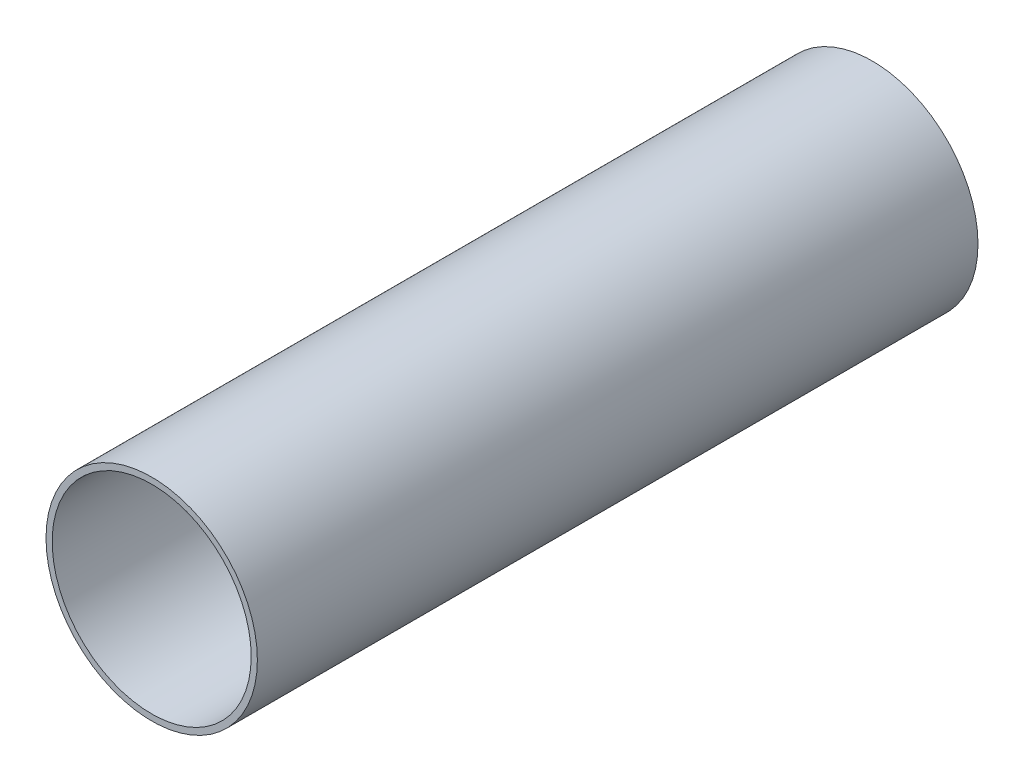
ISO-10303-21;
HEADER;
FILE_DESCRIPTION(('STEP AP214'),'2;1');
FILE_NAME('part.step','',(''),(''),'','','');
FILE_SCHEMA(('AUTOMOTIVE_DESIGN { 1 0 10303 214 1 1 1 1 }'));
ENDSEC;
DATA;
#1=APPLICATION_CONTEXT('core data for automotive mechanical design processes');
#2=APPLICATION_PROTOCOL_DEFINITION('international standard','automotive_design',2000,#1);
#3=PRODUCT_CONTEXT('',#1,'mechanical');
#4=PRODUCT('Part','Part','',(#3));
#5=PRODUCT_RELATED_PRODUCT_CATEGORY('part','',(#4));
#6=PRODUCT_DEFINITION_FORMATION('','',#4);
#7=PRODUCT_DEFINITION_CONTEXT('part definition',#1,'design');
#8=PRODUCT_DEFINITION('design','',#6,#7);
#9=PRODUCT_DEFINITION_SHAPE('','',#8);
#10=(LENGTH_UNIT() NAMED_UNIT(*) SI_UNIT(.MILLI.,.METRE.));
#11=(NAMED_UNIT(*) PLANE_ANGLE_UNIT() SI_UNIT($,.RADIAN.));
#12=(NAMED_UNIT(*) SI_UNIT($,.STERADIAN.) SOLID_ANGLE_UNIT());
#13=UNCERTAINTY_MEASURE_WITH_UNIT(LENGTH_MEASURE(1.E-05),#10,'distance_accuracy_value','');
#14=(GEOMETRIC_REPRESENTATION_CONTEXT(3) GLOBAL_UNCERTAINTY_ASSIGNED_CONTEXT((#13)) GLOBAL_UNIT_ASSIGNED_CONTEXT((#10,
#11,#12)) REPRESENTATION_CONTEXT('',''));
#15=CARTESIAN_POINT('',(0.,0.,0.));
#16=DIRECTION('',(0.,0.,1.));
#17=DIRECTION('',(1.,0.,0.));
#18=AXIS2_PLACEMENT_3D('',#15,#16,#17);
#19=CARTESIAN_POINT('',(0.,0.,205.));
#20=DIRECTION('',(0.,0.,-1.));
#21=DIRECTION('',(-1.,0.,0.));
#22=AXIS2_PLACEMENT_3D('',#19,#20,#21);
#23=CYLINDRICAL_SURFACE('',#22,30.065);
#24=CARTESIAN_POINT('',(0.,0.,205.));
#25=DIRECTION('',(0.,0.,1.));
#26=DIRECTION('',(1.,0.,0.));
#27=AXIS2_PLACEMENT_3D('',#24,#25,#26);
#28=CIRCLE('',#27,30.065);
#29=CARTESIAN_POINT('',(-30.065,0.,205.));
#30=VERTEX_POINT('',#29);
#31=EDGE_CURVE('E10',#30,#30,#28,.T.);
#32=CARTESIAN_POINT('',(0.,0.,0.));
#33=DIRECTION('',(0.,0.,1.));
#34=DIRECTION('',(1.,0.,0.));
#35=AXIS2_PLACEMENT_3D('',#32,#33,#34);
#36=CIRCLE('',#35,30.065);
#37=CARTESIAN_POINT('',(-30.065,0.,0.));
#38=VERTEX_POINT('',#37);
#39=EDGE_CURVE('E46',#38,#38,#36,.T.);
#40=CARTESIAN_POINT('',(-30.065,0.,205.));
#41=CARTESIAN_POINT('',(-30.065,0.,202.864583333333));
#42=CARTESIAN_POINT('',(-30.065,0.,200.729166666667));
#43=CARTESIAN_POINT('',(-30.065,0.,196.458333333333));
#44=CARTESIAN_POINT('',(-30.065,0.,194.322916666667));
#45=CARTESIAN_POINT('',(-30.065,0.,190.052083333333));
#46=CARTESIAN_POINT('',(-30.065,0.,187.916666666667));
#47=CARTESIAN_POINT('',(-30.065,0.,183.645833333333));
#48=CARTESIAN_POINT('',(-30.065,0.,181.510416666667));
#49=CARTESIAN_POINT('',(-30.065,0.,177.239583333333));
#50=CARTESIAN_POINT('',(-30.065,0.,175.104166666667));
#51=CARTESIAN_POINT('',(-30.065,0.,170.833333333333));
#52=CARTESIAN_POINT('',(-30.065,0.,168.697916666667));
#53=CARTESIAN_POINT('',(-30.065,0.,164.427083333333));
#54=CARTESIAN_POINT('',(-30.065,0.,162.291666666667));
#55=CARTESIAN_POINT('',(-30.065,0.,158.020833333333));
#56=CARTESIAN_POINT('',(-30.065,0.,155.885416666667));
#57=CARTESIAN_POINT('',(-30.065,0.,151.614583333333));
#58=CARTESIAN_POINT('',(-30.065,0.,149.479166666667));
#59=CARTESIAN_POINT('',(-30.065,0.,145.208333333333));
#60=CARTESIAN_POINT('',(-30.065,0.,143.072916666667));
#61=CARTESIAN_POINT('',(-30.065,0.,138.802083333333));
#62=CARTESIAN_POINT('',(-30.065,0.,136.666666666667));
#63=CARTESIAN_POINT('',(-30.065,0.,132.395833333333));
#64=CARTESIAN_POINT('',(-30.065,0.,130.260416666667));
#65=CARTESIAN_POINT('',(-30.065,0.,125.989583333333));
#66=CARTESIAN_POINT('',(-30.065,0.,123.854166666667));
#67=CARTESIAN_POINT('',(-30.065,0.,119.583333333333));
#68=CARTESIAN_POINT('',(-30.065,0.,117.447916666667));
#69=CARTESIAN_POINT('',(-30.065,0.,113.177083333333));
#70=CARTESIAN_POINT('',(-30.065,0.,111.041666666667));
#71=CARTESIAN_POINT('',(-30.065,0.,106.770833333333));
#72=CARTESIAN_POINT('',(-30.065,0.,104.635416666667));
#73=CARTESIAN_POINT('',(-30.065,0.,100.364583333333));
#74=CARTESIAN_POINT('',(-30.065,0.,98.2291666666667));
#75=CARTESIAN_POINT('',(-30.065,0.,93.9583333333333));
#76=CARTESIAN_POINT('',(-30.065,0.,91.8229166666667));
#77=CARTESIAN_POINT('',(-30.065,0.,87.5520833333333));
#78=CARTESIAN_POINT('',(-30.065,0.,85.4166666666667));
#79=CARTESIAN_POINT('',(-30.065,0.,81.1458333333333));
#80=CARTESIAN_POINT('',(-30.065,0.,79.0104166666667));
#81=CARTESIAN_POINT('',(-30.065,0.,74.7395833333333));
#82=CARTESIAN_POINT('',(-30.065,0.,72.6041666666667));
#83=CARTESIAN_POINT('',(-30.065,0.,68.3333333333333));
#84=CARTESIAN_POINT('',(-30.065,0.,66.1979166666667));
#85=CARTESIAN_POINT('',(-30.065,0.,61.9270833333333));
#86=CARTESIAN_POINT('',(-30.065,0.,59.7916666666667));
#87=CARTESIAN_POINT('',(-30.065,0.,55.5208333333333));
#88=CARTESIAN_POINT('',(-30.065,0.,53.3854166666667));
#89=CARTESIAN_POINT('',(-30.065,0.,49.1145833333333));
#90=CARTESIAN_POINT('',(-30.065,0.,46.9791666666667));
#91=CARTESIAN_POINT('',(-30.065,0.,42.7083333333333));
#92=CARTESIAN_POINT('',(-30.065,0.,40.5729166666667));
#93=CARTESIAN_POINT('',(-30.065,0.,36.3020833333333));
#94=CARTESIAN_POINT('',(-30.065,0.,34.1666666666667));
#95=CARTESIAN_POINT('',(-30.065,0.,29.8958333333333));
#96=CARTESIAN_POINT('',(-30.065,0.,27.7604166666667));
#97=CARTESIAN_POINT('',(-30.065,0.,23.4895833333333));
#98=CARTESIAN_POINT('',(-30.065,0.,21.3541666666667));
#99=CARTESIAN_POINT('',(-30.065,0.,17.0833333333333));
#100=CARTESIAN_POINT('',(-30.065,0.,14.9479166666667));
#101=CARTESIAN_POINT('',(-30.065,0.,10.6770833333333));
#102=CARTESIAN_POINT('',(-30.065,0.,8.54166666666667));
#103=CARTESIAN_POINT('',(-30.065,0.,4.27083333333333));
#104=CARTESIAN_POINT('',(-30.065,0.,2.13541666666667));
#105=CARTESIAN_POINT('',(-30.065,0.,0.));
#106=B_SPLINE_CURVE_WITH_KNOTS('',3,(#40,#41,#42,#43,#44,#45,#46,#47,#48,#49,#50,#51,#52,#53,
#54,#55,#56,#57,#58,#59,#60,#61,#62,#63,#64,#65,#66,#67,#68,#69,#70,#71,#72,#73,#74,#75,#76,#77,
#78,#79,#80,#81,#82,#83,#84,#85,#86,#87,#88,#89,#90,#91,#92,#93,#94,#95,#96,#97,#98,#99,#100,
#101,#102,#103,#104,#105),.UNSPECIFIED.,.F.,.F.,(4,2,2,2,2,2,2,2,2,2,2,2,2,2,2,2,2,2,2,2,2,2,2,
2,2,2,2,2,2,2,2,2,4),(0.,6.40624999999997,12.8125,19.21875,25.625,32.03125,38.4375,44.84375,
51.25,57.65625,64.0625,70.46875,76.875,83.28125,89.6875,96.09375,102.5,108.90625,115.3125,
121.71875,128.125,134.53125,140.9375,147.34375,153.75,160.15625,166.5625,172.96875,179.375,
185.78125,192.1875,198.59375,205.),.UNSPECIFIED.);
#107=EDGE_CURVE('BSEAM43',#30,#38,#106,.T.);
#108=ORIENTED_EDGE('',*,*,#31,.F.);
#109=ORIENTED_EDGE('',*,*,#39,.T.);
#110=ORIENTED_EDGE('',*,*,#107,.T.);
#111=ORIENTED_EDGE('',*,*,#107,.F.);
#112=EDGE_LOOP('',(#108,#110,#109,#111));
#113=FACE_BOUND('',#112,.T.);
#114=ADVANCED_FACE('F43',(#113),#23,.T.);
#115=CARTESIAN_POINT('',(0.,0.,205.));
#116=DIRECTION('',(0.,0.,1.));
#117=DIRECTION('',(1.,0.,0.));
#118=AXIS2_PLACEMENT_3D('',#115,#116,#117);
#119=PLANE('',#118);
#120=CARTESIAN_POINT('',(0.,0.,205.));
#121=DIRECTION('',(0.,0.,1.));
#122=DIRECTION('',(1.,0.,0.));
#123=AXIS2_PLACEMENT_3D('',#120,#121,#122);
#124=CIRCLE('',#123,28.31);
#125=CARTESIAN_POINT('',(28.31,0.,205.));
#126=VERTEX_POINT('',#125);
#127=EDGE_CURVE('E60',#126,#126,#124,.T.);
#128=ORIENTED_EDGE('',*,*,#127,.F.);
#129=EDGE_LOOP('',(#128));
#130=FACE_BOUND('',#129,.T.);
#131=ORIENTED_EDGE('',*,*,#31,.T.);
#132=EDGE_LOOP('',(#131));
#133=FACE_BOUND('',#132,.T.);
#134=ADVANCED_FACE('F72',(#130,#133),#119,.T.);
#135=CARTESIAN_POINT('',(0.,0.,0.));
#136=DIRECTION('',(0.,0.,1.));
#137=DIRECTION('',(1.,0.,0.));
#138=AXIS2_PLACEMENT_3D('',#135,#136,#137);
#139=PLANE('',#138);
#140=CARTESIAN_POINT('',(0.,0.,0.));
#141=DIRECTION('',(0.,0.,1.));
#142=DIRECTION('',(1.,0.,0.));
#143=AXIS2_PLACEMENT_3D('',#140,#141,#142);
#144=CIRCLE('',#143,28.31);
#145=CARTESIAN_POINT('',(28.31,0.,0.));
#146=VERTEX_POINT('',#145);
#147=EDGE_CURVE('E54',#146,#146,#144,.T.);
#148=ORIENTED_EDGE('',*,*,#147,.T.);
#149=EDGE_LOOP('',(#148));
#150=FACE_BOUND('',#149,.T.);
#151=ORIENTED_EDGE('',*,*,#39,.F.);
#152=EDGE_LOOP('',(#151));
#153=FACE_BOUND('',#152,.T.);
#154=ADVANCED_FACE('F64',(#150,#153),#139,.F.);
#155=CARTESIAN_POINT('',(0.,0.,0.));
#156=DIRECTION('',(0.,0.,1.));
#157=DIRECTION('',(1.,0.,0.));
#158=AXIS2_PLACEMENT_3D('',#155,#156,#157);
#159=CYLINDRICAL_SURFACE('',#158,28.31);
#160=CARTESIAN_POINT('',(28.31,0.,0.));
#161=CARTESIAN_POINT('',(28.31,0.,2.13541666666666));
#162=CARTESIAN_POINT('',(28.31,0.,4.27083333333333));
#163=CARTESIAN_POINT('',(28.31,0.,8.54166666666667));
#164=CARTESIAN_POINT('',(28.31,0.,10.6770833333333));
#165=CARTESIAN_POINT('',(28.31,0.,14.9479166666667));
#166=CARTESIAN_POINT('',(28.31,0.,17.0833333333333));
#167=CARTESIAN_POINT('',(28.31,0.,21.3541666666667));
#168=CARTESIAN_POINT('',(28.31,0.,23.4895833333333));
#169=CARTESIAN_POINT('',(28.31,0.,27.7604166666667));
#170=CARTESIAN_POINT('',(28.31,0.,29.8958333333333));
#171=CARTESIAN_POINT('',(28.31,0.,34.1666666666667));
#172=CARTESIAN_POINT('',(28.31,0.,36.3020833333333));
#173=CARTESIAN_POINT('',(28.31,0.,40.5729166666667));
#174=CARTESIAN_POINT('',(28.31,0.,42.7083333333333));
#175=CARTESIAN_POINT('',(28.31,0.,46.9791666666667));
#176=CARTESIAN_POINT('',(28.31,0.,49.1145833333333));
#177=CARTESIAN_POINT('',(28.31,0.,53.3854166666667));
#178=CARTESIAN_POINT('',(28.31,0.,55.5208333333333));
#179=CARTESIAN_POINT('',(28.31,0.,59.7916666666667));
#180=CARTESIAN_POINT('',(28.31,0.,61.9270833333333));
#181=CARTESIAN_POINT('',(28.31,0.,66.1979166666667));
#182=CARTESIAN_POINT('',(28.31,0.,68.3333333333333));
#183=CARTESIAN_POINT('',(28.31,0.,72.6041666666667));
#184=CARTESIAN_POINT('',(28.31,0.,74.7395833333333));
#185=CARTESIAN_POINT('',(28.31,0.,79.0104166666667));
#186=CARTESIAN_POINT('',(28.31,0.,81.1458333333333));
#187=CARTESIAN_POINT('',(28.31,0.,85.4166666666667));
#188=CARTESIAN_POINT('',(28.31,0.,87.5520833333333));
#189=CARTESIAN_POINT('',(28.31,0.,91.8229166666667));
#190=CARTESIAN_POINT('',(28.31,0.,93.9583333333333));
#191=CARTESIAN_POINT('',(28.31,0.,98.2291666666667));
#192=CARTESIAN_POINT('',(28.31,0.,100.364583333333));
#193=CARTESIAN_POINT('',(28.31,0.,104.635416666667));
#194=CARTESIAN_POINT('',(28.31,0.,106.770833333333));
#195=CARTESIAN_POINT('',(28.31,0.,111.041666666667));
#196=CARTESIAN_POINT('',(28.31,0.,113.177083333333));
#197=CARTESIAN_POINT('',(28.31,0.,117.447916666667));
#198=CARTESIAN_POINT('',(28.31,0.,119.583333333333));
#199=CARTESIAN_POINT('',(28.31,0.,123.854166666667));
#200=CARTESIAN_POINT('',(28.31,0.,125.989583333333));
#201=CARTESIAN_POINT('',(28.31,0.,130.260416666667));
#202=CARTESIAN_POINT('',(28.31,0.,132.395833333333));
#203=CARTESIAN_POINT('',(28.31,0.,136.666666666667));
#204=CARTESIAN_POINT('',(28.31,0.,138.802083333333));
#205=CARTESIAN_POINT('',(28.31,0.,143.072916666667));
#206=CARTESIAN_POINT('',(28.31,0.,145.208333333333));
#207=CARTESIAN_POINT('',(28.31,0.,149.479166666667));
#208=CARTESIAN_POINT('',(28.31,0.,151.614583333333));
#209=CARTESIAN_POINT('',(28.31,0.,155.885416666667));
#210=CARTESIAN_POINT('',(28.31,0.,158.020833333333));
#211=CARTESIAN_POINT('',(28.31,0.,162.291666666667));
#212=CARTESIAN_POINT('',(28.31,0.,164.427083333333));
#213=CARTESIAN_POINT('',(28.31,0.,168.697916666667));
#214=CARTESIAN_POINT('',(28.31,0.,170.833333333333));
#215=CARTESIAN_POINT('',(28.31,0.,175.104166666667));
#216=CARTESIAN_POINT('',(28.31,0.,177.239583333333));
#217=CARTESIAN_POINT('',(28.31,0.,181.510416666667));
#218=CARTESIAN_POINT('',(28.31,0.,183.645833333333));
#219=CARTESIAN_POINT('',(28.31,0.,187.916666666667));
#220=CARTESIAN_POINT('',(28.31,0.,190.052083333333));
#221=CARTESIAN_POINT('',(28.31,0.,194.322916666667));
#222=CARTESIAN_POINT('',(28.31,0.,196.458333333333));
#223=CARTESIAN_POINT('',(28.31,0.,200.729166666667));
#224=CARTESIAN_POINT('',(28.31,0.,202.864583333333));
#225=CARTESIAN_POINT('',(28.31,0.,205.));
#226=B_SPLINE_CURVE_WITH_KNOTS('',3,(#160,#161,#162,#163,#164,#165,#166,#167,#168,#169,#170,
#171,#172,#173,#174,#175,#176,#177,#178,#179,#180,#181,#182,#183,#184,#185,#186,#187,#188,#189,
#190,#191,#192,#193,#194,#195,#196,#197,#198,#199,#200,#201,#202,#203,#204,#205,#206,#207,#208,
#209,#210,#211,#212,#213,#214,#215,#216,#217,#218,#219,#220,#221,#222,#223,#224,#225),
.UNSPECIFIED.,.F.,.F.,(4,2,2,2,2,2,2,2,2,2,2,2,2,2,2,2,2,2,2,2,2,2,2,2,2,2,2,2,2,2,2,2,4),(0.,
6.40625,12.8125,19.21875,25.625,32.03125,38.4375,44.84375,51.25,57.65625,64.0625,70.46875,
76.875,83.28125,89.6875,96.09375,102.5,108.90625,115.3125,121.71875,128.125,134.53125,140.9375,
147.34375,153.75,160.15625,166.5625,172.96875,179.375,185.78125,192.1875,198.59375,205.),.UNSPECIFIED.);
#227=EDGE_CURVE('BSEAM66',#146,#126,#226,.T.);
#228=ORIENTED_EDGE('',*,*,#147,.F.);
#229=ORIENTED_EDGE('',*,*,#127,.T.);
#230=ORIENTED_EDGE('',*,*,#227,.T.);
#231=ORIENTED_EDGE('',*,*,#227,.F.);
#232=EDGE_LOOP('',(#228,#230,#229,#231));
#233=FACE_BOUND('',#232,.T.);
#234=ADVANCED_FACE('F66',(#233),#159,.F.);
#235=CLOSED_SHELL('',(#114,#134,#154,#234));
#236=MANIFOLD_SOLID_BREP('B2',#235);
#237=ADVANCED_BREP_SHAPE_REPRESENTATION('',(#18,#236),#14);
#238=SHAPE_DEFINITION_REPRESENTATION(#9,#237);
ENDSEC;
END-ISO-10303-21;
